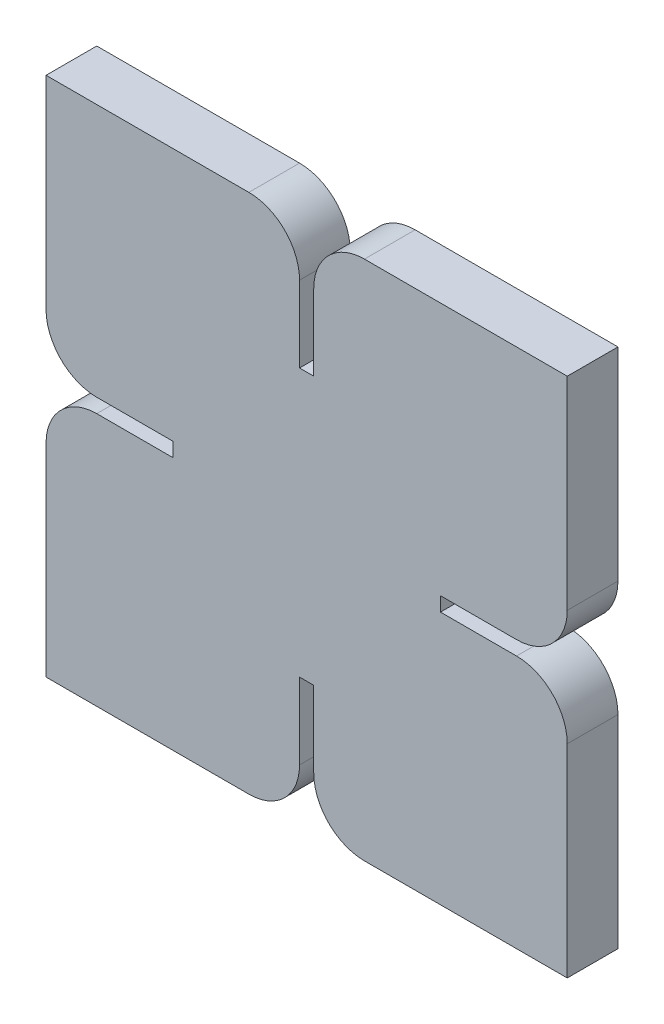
from build123d import *

# Parameters (mm, degrees)
BOSS_EXTRUDE1_DEPTH = 10


with BuildPart() as part:
    # Sketch1 → Boss-Extrude1 (new body)
    with BuildSketch(Plane.XY):
        with BuildLine():
            Line((1.4, 26.4), (1.4, 41.4))
            ThreePointArc((1.4, 41.4), (4.328932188, 48.471067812), (11.4, 51.4))
            Line((11.4, 51.4), (51.4, 51.4))
            Line((51.4, 51.4), (51.4, 11.4))
            ThreePointArc((51.4, 11.4), (48.471067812, 4.328932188), (41.4, 1.4))
            Line((41.4, 1.4), (26.4, 1.4))
            Line((26.4, 1.4), (26.4, -1.4))
            Line((26.4, -1.4), (41.4, -1.4))
            ThreePointArc((41.4, -1.4), (48.471067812, -4.328932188), (51.4, -11.4))
            Line((51.4, -11.4), (51.4, -51.4))
            Line((51.4, -51.4), (11.4, -51.4))
            ThreePointArc((11.4, -51.4), (4.328932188, -48.471067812), (1.4, -41.4))
            Line((1.4, -41.4), (1.4, -26.4))
            Line((1.4, -26.4), (-1.4, -26.4))
            Line((-1.4, -26.4), (-1.4, -41.4))
            ThreePointArc((-1.4, -41.4), (-4.328932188, -48.471067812), (-11.4, -51.4))
            Line((-11.4, -51.4), (-51.4, -51.4))
            Line((-51.4, -51.4), (-51.4, -11.4))
            ThreePointArc((-51.4, -11.4), (-48.471067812, -4.328932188), (-41.4, -1.4))
            Line((-41.4, -1.4), (-26.4, -1.4))
            Line((-26.4, -1.4), (-26.4, 1.4))
            Line((-26.4, 1.4), (-41.4, 1.4))
            ThreePointArc((-41.4, 1.4), (-48.471067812, 4.328932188), (-51.4, 11.4))
            Line((-51.4, 11.4), (-51.4, 51.4))
            Line((-51.4, 51.4), (-11.4, 51.4))
            ThreePointArc((-11.4, 51.4), (-4.328932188, 48.471067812), (-1.4, 41.4))
            Line((-1.4, 41.4), (-1.4, 26.4))
            Line((-1.4, 26.4), (1.4, 26.4))
        make_face()
    extrude(amount=BOSS_EXTRUDE1_DEPTH)


solid = part.part
